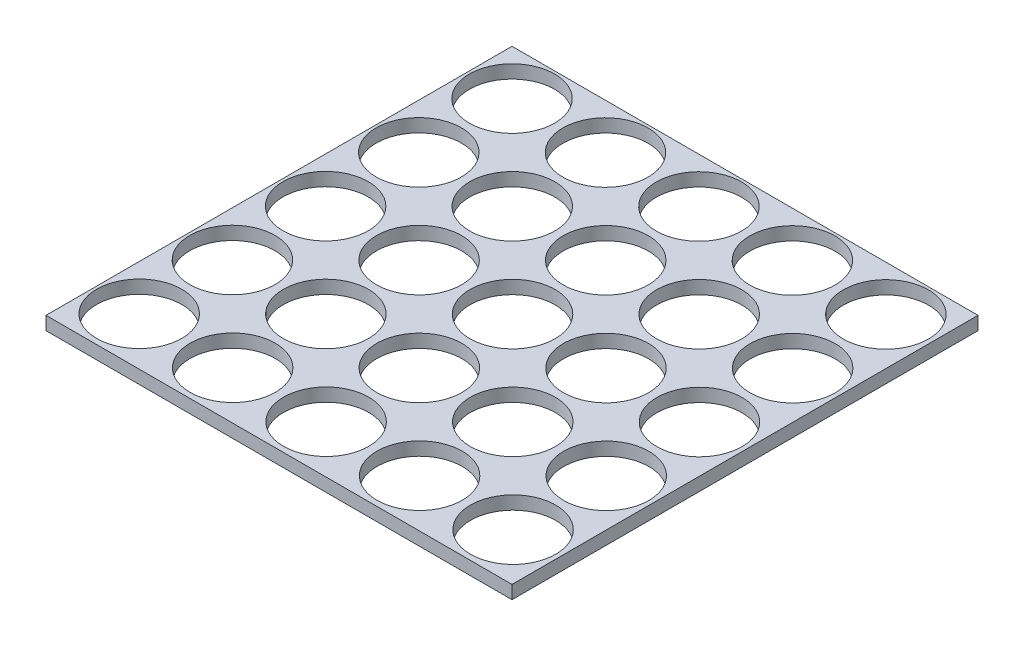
ISO-10303-21;
HEADER;
FILE_DESCRIPTION(('STEP AP214'),'2;1');
FILE_NAME('part.step','',(''),(''),'','','');
FILE_SCHEMA(('AUTOMOTIVE_DESIGN { 1 0 10303 214 1 1 1 1 }'));
ENDSEC;
DATA;
#1=APPLICATION_CONTEXT('core data for automotive mechanical design processes');
#2=APPLICATION_PROTOCOL_DEFINITION('international standard','automotive_design',2000,#1);
#3=PRODUCT_CONTEXT('',#1,'mechanical');
#4=PRODUCT('Part','Part','',(#3));
#5=PRODUCT_RELATED_PRODUCT_CATEGORY('part','',(#4));
#6=PRODUCT_DEFINITION_FORMATION('','',#4);
#7=PRODUCT_DEFINITION_CONTEXT('part definition',#1,'design');
#8=PRODUCT_DEFINITION('design','',#6,#7);
#9=PRODUCT_DEFINITION_SHAPE('','',#8);
#10=(LENGTH_UNIT() NAMED_UNIT(*) SI_UNIT(.MILLI.,.METRE.));
#11=(NAMED_UNIT(*) PLANE_ANGLE_UNIT() SI_UNIT($,.RADIAN.));
#12=(NAMED_UNIT(*) SI_UNIT($,.STERADIAN.) SOLID_ANGLE_UNIT());
#13=UNCERTAINTY_MEASURE_WITH_UNIT(LENGTH_MEASURE(1.E-05),#10,'distance_accuracy_value','');
#14=(GEOMETRIC_REPRESENTATION_CONTEXT(3) GLOBAL_UNCERTAINTY_ASSIGNED_CONTEXT((#13)) GLOBAL_UNIT_ASSIGNED_CONTEXT((#10,
#11,#12)) REPRESENTATION_CONTEXT('',''));
#15=CARTESIAN_POINT('',(0.,0.,0.));
#16=DIRECTION('',(0.,0.,1.));
#17=DIRECTION('',(1.,0.,0.));
#18=AXIS2_PLACEMENT_3D('',#15,#16,#17);
#19=CARTESIAN_POINT('',(-0.299999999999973,0.,69.7));
#20=DIRECTION('',(0.,1.,0.));
#21=DIRECTION('',(0.,0.,1.));
#22=AXIS2_PLACEMENT_3D('',#19,#20,#21);
#23=CYLINDRICAL_SURFACE('',#22,16.05);
#24=CARTESIAN_POINT('',(-0.299999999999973,0.,69.7));
#25=DIRECTION('',(0.,1.,0.));
#26=DIRECTION('',(0.,0.,1.));
#27=AXIS2_PLACEMENT_3D('',#24,#25,#26);
#28=CIRCLE('',#27,16.05);
#29=CARTESIAN_POINT('',(-0.299999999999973,0.,85.75));
#30=VERTEX_POINT('',#29);
#31=EDGE_CURVE('E48',#30,#30,#28,.T.);
#32=ORIENTED_EDGE('',*,*,#31,.F.);
#33=EDGE_LOOP('',(#32));
#34=FACE_BOUND('',#33,.T.);
#35=CARTESIAN_POINT('',(-0.299999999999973,5.,69.7));
#36=DIRECTION('',(0.,1.,0.));
#37=DIRECTION('',(0.,0.,1.));
#38=AXIS2_PLACEMENT_3D('',#35,#36,#37);
#39=CIRCLE('',#38,16.05);
#40=CARTESIAN_POINT('',(-0.299999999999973,5.,85.75));
#41=VERTEX_POINT('',#40);
#42=EDGE_CURVE('E11',#41,#41,#39,.T.);
#43=ORIENTED_EDGE('',*,*,#42,.T.);
#44=EDGE_LOOP('',(#43));
#45=FACE_BOUND('',#44,.T.);
#46=ADVANCED_FACE('F39',(#34,#45),#23,.F.);
#47=CARTESIAN_POINT('',(-0.299999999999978,0.,34.6));
#48=DIRECTION('',(0.,1.,0.));
#49=DIRECTION('',(0.,0.,1.));
#50=AXIS2_PLACEMENT_3D('',#47,#48,#49);
#51=CYLINDRICAL_SURFACE('',#50,16.05);
#52=CARTESIAN_POINT('',(-0.299999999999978,0.,34.6));
#53=DIRECTION('',(0.,1.,0.));
#54=DIRECTION('',(0.,0.,1.));
#55=AXIS2_PLACEMENT_3D('',#52,#53,#54);
#56=CIRCLE('',#55,16.05);
#57=CARTESIAN_POINT('',(-0.299999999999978,0.,50.65));
#58=VERTEX_POINT('',#57);
#59=EDGE_CURVE('E257',#58,#58,#56,.T.);
#60=ORIENTED_EDGE('',*,*,#59,.F.);
#61=EDGE_LOOP('',(#60));
#62=FACE_BOUND('',#61,.T.);
#63=CARTESIAN_POINT('',(-0.299999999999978,5.,34.6));
#64=DIRECTION('',(0.,1.,0.));
#65=DIRECTION('',(0.,0.,1.));
#66=AXIS2_PLACEMENT_3D('',#63,#64,#65);
#67=CIRCLE('',#66,16.05);
#68=CARTESIAN_POINT('',(-0.299999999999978,5.,50.65));
#69=VERTEX_POINT('',#68);
#70=EDGE_CURVE('E261',#69,#69,#67,.T.);
#71=ORIENTED_EDGE('',*,*,#70,.T.);
#72=EDGE_LOOP('',(#71));
#73=FACE_BOUND('',#72,.T.);
#74=ADVANCED_FACE('F272',(#62,#73),#51,.F.);
#75=CARTESIAN_POINT('',(-0.299999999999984,0.,-0.5));
#76=DIRECTION('',(0.,1.,0.));
#77=DIRECTION('',(0.,0.,1.));
#78=AXIS2_PLACEMENT_3D('',#75,#76,#77);
#79=CYLINDRICAL_SURFACE('',#78,16.05);
#80=CARTESIAN_POINT('',(-0.299999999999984,0.,-0.5));
#81=DIRECTION('',(0.,1.,0.));
#82=DIRECTION('',(0.,0.,1.));
#83=AXIS2_PLACEMENT_3D('',#80,#81,#82);
#84=CIRCLE('',#83,16.05);
#85=CARTESIAN_POINT('',(-0.299999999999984,0.,15.55));
#86=VERTEX_POINT('',#85);
#87=EDGE_CURVE('E249',#86,#86,#84,.T.);
#88=ORIENTED_EDGE('',*,*,#87,.F.);
#89=EDGE_LOOP('',(#88));
#90=FACE_BOUND('',#89,.T.);
#91=CARTESIAN_POINT('',(-0.299999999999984,5.,-0.5));
#92=DIRECTION('',(0.,1.,0.));
#93=DIRECTION('',(0.,0.,1.));
#94=AXIS2_PLACEMENT_3D('',#91,#92,#93);
#95=CIRCLE('',#94,16.05);
#96=CARTESIAN_POINT('',(-0.299999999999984,5.,15.55));
#97=VERTEX_POINT('',#96);
#98=EDGE_CURVE('E253',#97,#97,#95,.T.);
#99=ORIENTED_EDGE('',*,*,#98,.T.);
#100=EDGE_LOOP('',(#99));
#101=FACE_BOUND('',#100,.T.);
#102=ADVANCED_FACE('F359',(#90,#101),#79,.F.);
#103=CARTESIAN_POINT('',(34.9,0.,69.7));
#104=DIRECTION('',(0.,1.,0.));
#105=DIRECTION('',(0.,0.,1.));
#106=AXIS2_PLACEMENT_3D('',#103,#104,#105);
#107=CYLINDRICAL_SURFACE('',#106,16.05);
#108=CARTESIAN_POINT('',(34.9,0.,69.7));
#109=DIRECTION('',(0.,1.,0.));
#110=DIRECTION('',(0.,0.,1.));
#111=AXIS2_PLACEMENT_3D('',#108,#109,#110);
#112=CIRCLE('',#111,16.05);
#113=CARTESIAN_POINT('',(34.9,0.,85.75));
#114=VERTEX_POINT('',#113);
#115=EDGE_CURVE('E241',#114,#114,#112,.T.);
#116=ORIENTED_EDGE('',*,*,#115,.F.);
#117=EDGE_LOOP('',(#116));
#118=FACE_BOUND('',#117,.T.);
#119=CARTESIAN_POINT('',(34.9,5.,69.7));
#120=DIRECTION('',(0.,1.,0.));
#121=DIRECTION('',(0.,0.,1.));
#122=AXIS2_PLACEMENT_3D('',#119,#120,#121);
#123=CIRCLE('',#122,16.05);
#124=CARTESIAN_POINT('',(34.9,5.,85.75));
#125=VERTEX_POINT('',#124);
#126=EDGE_CURVE('E245',#125,#125,#123,.T.);
#127=ORIENTED_EDGE('',*,*,#126,.T.);
#128=EDGE_LOOP('',(#127));
#129=FACE_BOUND('',#128,.T.);
#130=ADVANCED_FACE('F355',(#118,#129),#107,.F.);
#131=CARTESIAN_POINT('',(34.9,0.,34.6));
#132=DIRECTION('',(0.,1.,0.));
#133=DIRECTION('',(0.,0.,1.));
#134=AXIS2_PLACEMENT_3D('',#131,#132,#133);
#135=CYLINDRICAL_SURFACE('',#134,16.05);
#136=CARTESIAN_POINT('',(34.9,0.,34.6));
#137=DIRECTION('',(0.,1.,0.));
#138=DIRECTION('',(0.,0.,1.));
#139=AXIS2_PLACEMENT_3D('',#136,#137,#138);
#140=CIRCLE('',#139,16.05);
#141=CARTESIAN_POINT('',(34.9,0.,50.65));
#142=VERTEX_POINT('',#141);
#143=EDGE_CURVE('E233',#142,#142,#140,.T.);
#144=ORIENTED_EDGE('',*,*,#143,.F.);
#145=EDGE_LOOP('',(#144));
#146=FACE_BOUND('',#145,.T.);
#147=CARTESIAN_POINT('',(34.9,5.,34.6));
#148=DIRECTION('',(0.,1.,0.));
#149=DIRECTION('',(0.,0.,1.));
#150=AXIS2_PLACEMENT_3D('',#147,#148,#149);
#151=CIRCLE('',#150,16.05);
#152=CARTESIAN_POINT('',(34.9,5.,50.65));
#153=VERTEX_POINT('',#152);
#154=EDGE_CURVE('E237',#153,#153,#151,.T.);
#155=ORIENTED_EDGE('',*,*,#154,.T.);
#156=EDGE_LOOP('',(#155));
#157=FACE_BOUND('',#156,.T.);
#158=ADVANCED_FACE('F351',(#146,#157),#135,.F.);
#159=CARTESIAN_POINT('',(34.9,0.,-0.5));
#160=DIRECTION('',(0.,1.,0.));
#161=DIRECTION('',(0.,0.,1.));
#162=AXIS2_PLACEMENT_3D('',#159,#160,#161);
#163=CYLINDRICAL_SURFACE('',#162,16.05);
#164=CARTESIAN_POINT('',(34.9,0.,-0.5));
#165=DIRECTION('',(0.,1.,0.));
#166=DIRECTION('',(0.,0.,1.));
#167=AXIS2_PLACEMENT_3D('',#164,#165,#166);
#168=CIRCLE('',#167,16.05);
#169=CARTESIAN_POINT('',(34.9,0.,15.55));
#170=VERTEX_POINT('',#169);
#171=EDGE_CURVE('E225',#170,#170,#168,.T.);
#172=ORIENTED_EDGE('',*,*,#171,.F.);
#173=EDGE_LOOP('',(#172));
#174=FACE_BOUND('',#173,.T.);
#175=CARTESIAN_POINT('',(34.9,5.,-0.5));
#176=DIRECTION('',(0.,1.,0.));
#177=DIRECTION('',(0.,0.,1.));
#178=AXIS2_PLACEMENT_3D('',#175,#176,#177);
#179=CIRCLE('',#178,16.05);
#180=CARTESIAN_POINT('',(34.9,5.,15.55));
#181=VERTEX_POINT('',#180);
#182=EDGE_CURVE('E229',#181,#181,#179,.T.);
#183=ORIENTED_EDGE('',*,*,#182,.T.);
#184=EDGE_LOOP('',(#183));
#185=FACE_BOUND('',#184,.T.);
#186=ADVANCED_FACE('F347',(#174,#185),#163,.F.);
#187=CARTESIAN_POINT('',(70.1,0.,69.7));
#188=DIRECTION('',(0.,1.,0.));
#189=DIRECTION('',(0.,0.,1.));
#190=AXIS2_PLACEMENT_3D('',#187,#188,#189);
#191=CYLINDRICAL_SURFACE('',#190,16.05);
#192=CARTESIAN_POINT('',(70.1,0.,69.7));
#193=DIRECTION('',(0.,1.,0.));
#194=DIRECTION('',(0.,0.,1.));
#195=AXIS2_PLACEMENT_3D('',#192,#193,#194);
#196=CIRCLE('',#195,16.05);
#197=CARTESIAN_POINT('',(70.1,0.,85.75));
#198=VERTEX_POINT('',#197);
#199=EDGE_CURVE('E217',#198,#198,#196,.T.);
#200=ORIENTED_EDGE('',*,*,#199,.F.);
#201=EDGE_LOOP('',(#200));
#202=FACE_BOUND('',#201,.T.);
#203=CARTESIAN_POINT('',(70.1,5.,69.7));
#204=DIRECTION('',(0.,1.,0.));
#205=DIRECTION('',(0.,0.,1.));
#206=AXIS2_PLACEMENT_3D('',#203,#204,#205);
#207=CIRCLE('',#206,16.05);
#208=CARTESIAN_POINT('',(70.1,5.,85.75));
#209=VERTEX_POINT('',#208);
#210=EDGE_CURVE('E221',#209,#209,#207,.T.);
#211=ORIENTED_EDGE('',*,*,#210,.T.);
#212=EDGE_LOOP('',(#211));
#213=FACE_BOUND('',#212,.T.);
#214=ADVANCED_FACE('F343',(#202,#213),#191,.F.);
#215=CARTESIAN_POINT('',(70.1,0.,34.6));
#216=DIRECTION('',(0.,1.,0.));
#217=DIRECTION('',(0.,0.,1.));
#218=AXIS2_PLACEMENT_3D('',#215,#216,#217);
#219=CYLINDRICAL_SURFACE('',#218,16.05);
#220=CARTESIAN_POINT('',(70.1,0.,34.6));
#221=DIRECTION('',(0.,1.,0.));
#222=DIRECTION('',(0.,0.,1.));
#223=AXIS2_PLACEMENT_3D('',#220,#221,#222);
#224=CIRCLE('',#223,16.05);
#225=CARTESIAN_POINT('',(70.1,0.,50.65));
#226=VERTEX_POINT('',#225);
#227=EDGE_CURVE('E209',#226,#226,#224,.T.);
#228=ORIENTED_EDGE('',*,*,#227,.F.);
#229=EDGE_LOOP('',(#228));
#230=FACE_BOUND('',#229,.T.);
#231=CARTESIAN_POINT('',(70.1,5.,34.6));
#232=DIRECTION('',(0.,1.,0.));
#233=DIRECTION('',(0.,0.,1.));
#234=AXIS2_PLACEMENT_3D('',#231,#232,#233);
#235=CIRCLE('',#234,16.05);
#236=CARTESIAN_POINT('',(70.1,5.,50.65));
#237=VERTEX_POINT('',#236);
#238=EDGE_CURVE('E213',#237,#237,#235,.T.);
#239=ORIENTED_EDGE('',*,*,#238,.T.);
#240=EDGE_LOOP('',(#239));
#241=FACE_BOUND('',#240,.T.);
#242=ADVANCED_FACE('F339',(#230,#241),#219,.F.);
#243=CARTESIAN_POINT('',(70.1,0.,-0.5));
#244=DIRECTION('',(0.,1.,0.));
#245=DIRECTION('',(0.,0.,1.));
#246=AXIS2_PLACEMENT_3D('',#243,#244,#245);
#247=CYLINDRICAL_SURFACE('',#246,16.05);
#248=CARTESIAN_POINT('',(70.1,0.,-0.5));
#249=DIRECTION('',(0.,1.,0.));
#250=DIRECTION('',(0.,0.,1.));
#251=AXIS2_PLACEMENT_3D('',#248,#249,#250);
#252=CIRCLE('',#251,16.05);
#253=CARTESIAN_POINT('',(70.1,0.,15.55));
#254=VERTEX_POINT('',#253);
#255=EDGE_CURVE('E201',#254,#254,#252,.T.);
#256=ORIENTED_EDGE('',*,*,#255,.F.);
#257=EDGE_LOOP('',(#256));
#258=FACE_BOUND('',#257,.T.);
#259=CARTESIAN_POINT('',(70.1,5.,-0.5));
#260=DIRECTION('',(0.,1.,0.));
#261=DIRECTION('',(0.,0.,1.));
#262=AXIS2_PLACEMENT_3D('',#259,#260,#261);
#263=CIRCLE('',#262,16.05);
#264=CARTESIAN_POINT('',(70.1,5.,15.55));
#265=VERTEX_POINT('',#264);
#266=EDGE_CURVE('E205',#265,#265,#263,.T.);
#267=ORIENTED_EDGE('',*,*,#266,.T.);
#268=EDGE_LOOP('',(#267));
#269=FACE_BOUND('',#268,.T.);
#270=ADVANCED_FACE('F335',(#258,#269),#247,.F.);
#271=CARTESIAN_POINT('',(-70.7,0.,69.7));
#272=DIRECTION('',(0.,1.,0.));
#273=DIRECTION('',(0.,0.,1.));
#274=AXIS2_PLACEMENT_3D('',#271,#272,#273);
#275=CYLINDRICAL_SURFACE('',#274,16.05);
#276=CARTESIAN_POINT('',(-70.7,0.,69.7));
#277=DIRECTION('',(0.,1.,0.));
#278=DIRECTION('',(0.,0.,1.));
#279=AXIS2_PLACEMENT_3D('',#276,#277,#278);
#280=CIRCLE('',#279,16.05);
#281=CARTESIAN_POINT('',(-70.7,0.,85.75));
#282=VERTEX_POINT('',#281);
#283=EDGE_CURVE('E193',#282,#282,#280,.T.);
#284=ORIENTED_EDGE('',*,*,#283,.F.);
#285=EDGE_LOOP('',(#284));
#286=FACE_BOUND('',#285,.T.);
#287=CARTESIAN_POINT('',(-70.7,5.,69.7));
#288=DIRECTION('',(0.,1.,0.));
#289=DIRECTION('',(0.,0.,1.));
#290=AXIS2_PLACEMENT_3D('',#287,#288,#289);
#291=CIRCLE('',#290,16.05);
#292=CARTESIAN_POINT('',(-70.7,5.,85.75));
#293=VERTEX_POINT('',#292);
#294=EDGE_CURVE('E197',#293,#293,#291,.T.);
#295=ORIENTED_EDGE('',*,*,#294,.T.);
#296=EDGE_LOOP('',(#295));
#297=FACE_BOUND('',#296,.T.);
#298=ADVANCED_FACE('F331',(#286,#297),#275,.F.);
#299=CARTESIAN_POINT('',(-70.7,0.,34.6));
#300=DIRECTION('',(0.,1.,0.));
#301=DIRECTION('',(0.,0.,1.));
#302=AXIS2_PLACEMENT_3D('',#299,#300,#301);
#303=CYLINDRICAL_SURFACE('',#302,16.05);
#304=CARTESIAN_POINT('',(-70.7,0.,34.6));
#305=DIRECTION('',(0.,1.,0.));
#306=DIRECTION('',(0.,0.,1.));
#307=AXIS2_PLACEMENT_3D('',#304,#305,#306);
#308=CIRCLE('',#307,16.05);
#309=CARTESIAN_POINT('',(-70.7,0.,50.65));
#310=VERTEX_POINT('',#309);
#311=EDGE_CURVE('E185',#310,#310,#308,.T.);
#312=ORIENTED_EDGE('',*,*,#311,.F.);
#313=EDGE_LOOP('',(#312));
#314=FACE_BOUND('',#313,.T.);
#315=CARTESIAN_POINT('',(-70.7,5.,34.6));
#316=DIRECTION('',(0.,1.,0.));
#317=DIRECTION('',(0.,0.,1.));
#318=AXIS2_PLACEMENT_3D('',#315,#316,#317);
#319=CIRCLE('',#318,16.05);
#320=CARTESIAN_POINT('',(-70.7,5.,50.65));
#321=VERTEX_POINT('',#320);
#322=EDGE_CURVE('E189',#321,#321,#319,.T.);
#323=ORIENTED_EDGE('',*,*,#322,.T.);
#324=EDGE_LOOP('',(#323));
#325=FACE_BOUND('',#324,.T.);
#326=ADVANCED_FACE('F327',(#314,#325),#303,.F.);
#327=CARTESIAN_POINT('',(-70.7,0.,-0.5));
#328=DIRECTION('',(0.,1.,0.));
#329=DIRECTION('',(0.,0.,1.));
#330=AXIS2_PLACEMENT_3D('',#327,#328,#329);
#331=CYLINDRICAL_SURFACE('',#330,16.05);
#332=CARTESIAN_POINT('',(-70.7,0.,-0.5));
#333=DIRECTION('',(0.,1.,0.));
#334=DIRECTION('',(0.,0.,1.));
#335=AXIS2_PLACEMENT_3D('',#332,#333,#334);
#336=CIRCLE('',#335,16.05);
#337=CARTESIAN_POINT('',(-70.7,0.,15.55));
#338=VERTEX_POINT('',#337);
#339=EDGE_CURVE('E177',#338,#338,#336,.T.);
#340=ORIENTED_EDGE('',*,*,#339,.F.);
#341=EDGE_LOOP('',(#340));
#342=FACE_BOUND('',#341,.T.);
#343=CARTESIAN_POINT('',(-70.7,5.,-0.5));
#344=DIRECTION('',(0.,1.,0.));
#345=DIRECTION('',(0.,0.,1.));
#346=AXIS2_PLACEMENT_3D('',#343,#344,#345);
#347=CIRCLE('',#346,16.05);
#348=CARTESIAN_POINT('',(-70.7,5.,15.55));
#349=VERTEX_POINT('',#348);
#350=EDGE_CURVE('E181',#349,#349,#347,.T.);
#351=ORIENTED_EDGE('',*,*,#350,.T.);
#352=EDGE_LOOP('',(#351));
#353=FACE_BOUND('',#352,.T.);
#354=ADVANCED_FACE('F323',(#342,#353),#331,.F.);
#355=CARTESIAN_POINT('',(-35.5,0.,69.7));
#356=DIRECTION('',(0.,1.,0.));
#357=DIRECTION('',(0.,0.,1.));
#358=AXIS2_PLACEMENT_3D('',#355,#356,#357);
#359=CYLINDRICAL_SURFACE('',#358,16.05);
#360=CARTESIAN_POINT('',(-35.5,0.,69.7));
#361=DIRECTION('',(0.,1.,0.));
#362=DIRECTION('',(0.,0.,1.));
#363=AXIS2_PLACEMENT_3D('',#360,#361,#362);
#364=CIRCLE('',#363,16.05);
#365=CARTESIAN_POINT('',(-35.5,0.,85.75));
#366=VERTEX_POINT('',#365);
#367=EDGE_CURVE('E169',#366,#366,#364,.T.);
#368=ORIENTED_EDGE('',*,*,#367,.F.);
#369=EDGE_LOOP('',(#368));
#370=FACE_BOUND('',#369,.T.);
#371=CARTESIAN_POINT('',(-35.5,5.,69.7));
#372=DIRECTION('',(0.,1.,0.));
#373=DIRECTION('',(0.,0.,1.));
#374=AXIS2_PLACEMENT_3D('',#371,#372,#373);
#375=CIRCLE('',#374,16.05);
#376=CARTESIAN_POINT('',(-35.5,5.,85.75));
#377=VERTEX_POINT('',#376);
#378=EDGE_CURVE('E173',#377,#377,#375,.T.);
#379=ORIENTED_EDGE('',*,*,#378,.T.);
#380=EDGE_LOOP('',(#379));
#381=FACE_BOUND('',#380,.T.);
#382=ADVANCED_FACE('F319',(#370,#381),#359,.F.);
#383=CARTESIAN_POINT('',(-35.5,0.,34.6));
#384=DIRECTION('',(0.,1.,0.));
#385=DIRECTION('',(0.,0.,1.));
#386=AXIS2_PLACEMENT_3D('',#383,#384,#385);
#387=CYLINDRICAL_SURFACE('',#386,16.05);
#388=CARTESIAN_POINT('',(-35.5,0.,34.6));
#389=DIRECTION('',(0.,1.,0.));
#390=DIRECTION('',(0.,0.,1.));
#391=AXIS2_PLACEMENT_3D('',#388,#389,#390);
#392=CIRCLE('',#391,16.05);
#393=CARTESIAN_POINT('',(-35.5,0.,50.65));
#394=VERTEX_POINT('',#393);
#395=EDGE_CURVE('E161',#394,#394,#392,.T.);
#396=ORIENTED_EDGE('',*,*,#395,.F.);
#397=EDGE_LOOP('',(#396));
#398=FACE_BOUND('',#397,.T.);
#399=CARTESIAN_POINT('',(-35.5,5.,34.6));
#400=DIRECTION('',(0.,1.,0.));
#401=DIRECTION('',(0.,0.,1.));
#402=AXIS2_PLACEMENT_3D('',#399,#400,#401);
#403=CIRCLE('',#402,16.05);
#404=CARTESIAN_POINT('',(-35.5,5.,50.65));
#405=VERTEX_POINT('',#404);
#406=EDGE_CURVE('E165',#405,#405,#403,.T.);
#407=ORIENTED_EDGE('',*,*,#406,.T.);
#408=EDGE_LOOP('',(#407));
#409=FACE_BOUND('',#408,.T.);
#410=ADVANCED_FACE('F315',(#398,#409),#387,.F.);
#411=CARTESIAN_POINT('',(-35.5,0.,-0.5));
#412=DIRECTION('',(0.,1.,0.));
#413=DIRECTION('',(0.,0.,1.));
#414=AXIS2_PLACEMENT_3D('',#411,#412,#413);
#415=CYLINDRICAL_SURFACE('',#414,16.05);
#416=CARTESIAN_POINT('',(-35.5,0.,-0.5));
#417=DIRECTION('',(0.,1.,0.));
#418=DIRECTION('',(0.,0.,1.));
#419=AXIS2_PLACEMENT_3D('',#416,#417,#418);
#420=CIRCLE('',#419,16.05);
#421=CARTESIAN_POINT('',(-35.5,0.,15.55));
#422=VERTEX_POINT('',#421);
#423=EDGE_CURVE('E153',#422,#422,#420,.T.);
#424=ORIENTED_EDGE('',*,*,#423,.F.);
#425=EDGE_LOOP('',(#424));
#426=FACE_BOUND('',#425,.T.);
#427=CARTESIAN_POINT('',(-35.5,5.,-0.5));
#428=DIRECTION('',(0.,1.,0.));
#429=DIRECTION('',(0.,0.,1.));
#430=AXIS2_PLACEMENT_3D('',#427,#428,#429);
#431=CIRCLE('',#430,16.05);
#432=CARTESIAN_POINT('',(-35.5,5.,15.55));
#433=VERTEX_POINT('',#432);
#434=EDGE_CURVE('E157',#433,#433,#431,.T.);
#435=ORIENTED_EDGE('',*,*,#434,.T.);
#436=EDGE_LOOP('',(#435));
#437=FACE_BOUND('',#436,.T.);
#438=ADVANCED_FACE('F311',(#426,#437),#415,.F.);
#439=CARTESIAN_POINT('',(70.1,0.,-70.7));
#440=DIRECTION('',(0.,1.,0.));
#441=DIRECTION('',(0.,0.,1.));
#442=AXIS2_PLACEMENT_3D('',#439,#440,#441);
#443=CYLINDRICAL_SURFACE('',#442,16.05);
#444=CARTESIAN_POINT('',(70.1,0.,-70.7));
#445=DIRECTION('',(0.,1.,0.));
#446=DIRECTION('',(0.,0.,1.));
#447=AXIS2_PLACEMENT_3D('',#444,#445,#446);
#448=CIRCLE('',#447,16.05);
#449=CARTESIAN_POINT('',(70.1,0.,-54.65));
#450=VERTEX_POINT('',#449);
#451=EDGE_CURVE('E145',#450,#450,#448,.T.);
#452=ORIENTED_EDGE('',*,*,#451,.F.);
#453=EDGE_LOOP('',(#452));
#454=FACE_BOUND('',#453,.T.);
#455=CARTESIAN_POINT('',(70.1,5.,-70.7));
#456=DIRECTION('',(0.,1.,0.));
#457=DIRECTION('',(0.,0.,1.));
#458=AXIS2_PLACEMENT_3D('',#455,#456,#457);
#459=CIRCLE('',#458,16.05);
#460=CARTESIAN_POINT('',(70.1,5.,-54.65));
#461=VERTEX_POINT('',#460);
#462=EDGE_CURVE('E149',#461,#461,#459,.T.);
#463=ORIENTED_EDGE('',*,*,#462,.T.);
#464=EDGE_LOOP('',(#463));
#465=FACE_BOUND('',#464,.T.);
#466=ADVANCED_FACE('F307',(#454,#465),#443,.F.);
#467=CARTESIAN_POINT('',(34.9,0.,-70.7));
#468=DIRECTION('',(0.,1.,0.));
#469=DIRECTION('',(0.,0.,1.));
#470=AXIS2_PLACEMENT_3D('',#467,#468,#469);
#471=CYLINDRICAL_SURFACE('',#470,16.05);
#472=CARTESIAN_POINT('',(34.9,0.,-70.7));
#473=DIRECTION('',(0.,1.,0.));
#474=DIRECTION('',(0.,0.,1.));
#475=AXIS2_PLACEMENT_3D('',#472,#473,#474);
#476=CIRCLE('',#475,16.05);
#477=CARTESIAN_POINT('',(34.9,0.,-54.65));
#478=VERTEX_POINT('',#477);
#479=EDGE_CURVE('E137',#478,#478,#476,.T.);
#480=ORIENTED_EDGE('',*,*,#479,.F.);
#481=EDGE_LOOP('',(#480));
#482=FACE_BOUND('',#481,.T.);
#483=CARTESIAN_POINT('',(34.9,5.,-70.7));
#484=DIRECTION('',(0.,1.,0.));
#485=DIRECTION('',(0.,0.,1.));
#486=AXIS2_PLACEMENT_3D('',#483,#484,#485);
#487=CIRCLE('',#486,16.05);
#488=CARTESIAN_POINT('',(34.9,5.,-54.65));
#489=VERTEX_POINT('',#488);
#490=EDGE_CURVE('E141',#489,#489,#487,.T.);
#491=ORIENTED_EDGE('',*,*,#490,.T.);
#492=EDGE_LOOP('',(#491));
#493=FACE_BOUND('',#492,.T.);
#494=ADVANCED_FACE('F303',(#482,#493),#471,.F.);
#495=CARTESIAN_POINT('',(-0.299999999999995,0.,-70.7));
#496=DIRECTION('',(0.,1.,0.));
#497=DIRECTION('',(0.,0.,1.));
#498=AXIS2_PLACEMENT_3D('',#495,#496,#497);
#499=CYLINDRICAL_SURFACE('',#498,16.05);
#500=CARTESIAN_POINT('',(-0.299999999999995,0.,-70.7));
#501=DIRECTION('',(0.,1.,0.));
#502=DIRECTION('',(0.,0.,1.));
#503=AXIS2_PLACEMENT_3D('',#500,#501,#502);
#504=CIRCLE('',#503,16.05);
#505=CARTESIAN_POINT('',(-0.299999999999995,0.,-54.65));
#506=VERTEX_POINT('',#505);
#507=EDGE_CURVE('E129',#506,#506,#504,.T.);
#508=ORIENTED_EDGE('',*,*,#507,.F.);
#509=EDGE_LOOP('',(#508));
#510=FACE_BOUND('',#509,.T.);
#511=CARTESIAN_POINT('',(-0.299999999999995,5.,-70.7));
#512=DIRECTION('',(0.,1.,0.));
#513=DIRECTION('',(0.,0.,1.));
#514=AXIS2_PLACEMENT_3D('',#511,#512,#513);
#515=CIRCLE('',#514,16.05);
#516=CARTESIAN_POINT('',(-0.299999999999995,5.,-54.65));
#517=VERTEX_POINT('',#516);
#518=EDGE_CURVE('E133',#517,#517,#515,.T.);
#519=ORIENTED_EDGE('',*,*,#518,.T.);
#520=EDGE_LOOP('',(#519));
#521=FACE_BOUND('',#520,.T.);
#522=ADVANCED_FACE('F299',(#510,#521),#499,.F.);
#523=CARTESIAN_POINT('',(87.75,5.,-87.75));
#524=DIRECTION('',(-1.,0.,0.));
#525=DIRECTION('',(0.,0.,1.));
#526=AXIS2_PLACEMENT_3D('',#523,#524,#525);
#527=PLANE('',#526);
#528=DIRECTION('',(0.,0.,-1.));
#529=VECTOR('',#528,1.);
#530=CARTESIAN_POINT('',(87.75,0.,-87.75));
#531=LINE('',#530,#529);
#532=CARTESIAN_POINT('',(87.75,0.,87.75));
#533=VERTEX_POINT('',#532);
#534=CARTESIAN_POINT('',(87.75,0.,-87.75));
#535=VERTEX_POINT('',#534);
#536=EDGE_CURVE('E112',#533,#535,#531,.T.);
#537=ORIENTED_EDGE('',*,*,#536,.T.);
#538=DIRECTION('',(0.,-1.,0.));
#539=VECTOR('',#538,1.);
#540=CARTESIAN_POINT('',(87.75,5.,-87.75));
#541=LINE('',#540,#539);
#542=CARTESIAN_POINT('',(87.75,5.,-87.75));
#543=VERTEX_POINT('',#542);
#544=EDGE_CURVE('E101',#543,#535,#541,.T.);
#545=ORIENTED_EDGE('',*,*,#544,.F.);
#546=DIRECTION('',(0.,0.,-1.));
#547=VECTOR('',#546,1.);
#548=CARTESIAN_POINT('',(87.75,5.,-87.75));
#549=LINE('',#548,#547);
#550=CARTESIAN_POINT('',(87.75,5.,87.75));
#551=VERTEX_POINT('',#550);
#552=EDGE_CURVE('E93',#551,#543,#549,.T.);
#553=ORIENTED_EDGE('',*,*,#552,.F.);
#554=DIRECTION('',(0.,-1.,0.));
#555=VECTOR('',#554,1.);
#556=CARTESIAN_POINT('',(87.75,5.,87.75));
#557=LINE('',#556,#555);
#558=EDGE_CURVE('E108',#551,#533,#557,.T.);
#559=ORIENTED_EDGE('',*,*,#558,.T.);
#560=EDGE_LOOP('',(#537,#545,#553,#559));
#561=FACE_BOUND('',#560,.T.);
#562=ADVANCED_FACE('F296',(#561),#527,.F.);
#563=CARTESIAN_POINT('',(-87.75,5.,-87.75));
#564=DIRECTION('',(0.,0.,1.));
#565=DIRECTION('',(1.,0.,0.));
#566=AXIS2_PLACEMENT_3D('',#563,#564,#565);
#567=PLANE('',#566);
#568=DIRECTION('',(-1.,0.,0.));
#569=VECTOR('',#568,1.);
#570=CARTESIAN_POINT('',(-87.75,0.,-87.75));
#571=LINE('',#570,#569);
#572=CARTESIAN_POINT('',(-87.75,0.,-87.75));
#573=VERTEX_POINT('',#572);
#574=EDGE_CURVE('E99',#535,#573,#571,.T.);
#575=ORIENTED_EDGE('',*,*,#574,.T.);
#576=DIRECTION('',(0.,-1.,0.));
#577=VECTOR('',#576,1.);
#578=CARTESIAN_POINT('',(-87.75,5.,-87.75));
#579=LINE('',#578,#577);
#580=CARTESIAN_POINT('',(-87.75,5.,-87.75));
#581=VERTEX_POINT('',#580);
#582=EDGE_CURVE('E97',#581,#573,#579,.T.);
#583=ORIENTED_EDGE('',*,*,#582,.F.);
#584=DIRECTION('',(-1.,0.,0.));
#585=VECTOR('',#584,1.);
#586=CARTESIAN_POINT('',(-87.75,5.,-87.75));
#587=LINE('',#586,#585);
#588=EDGE_CURVE('E87',#543,#581,#587,.T.);
#589=ORIENTED_EDGE('',*,*,#588,.F.);
#590=ORIENTED_EDGE('',*,*,#544,.T.);
#591=EDGE_LOOP('',(#575,#583,#589,#590));
#592=FACE_BOUND('',#591,.T.);
#593=ADVANCED_FACE('F98',(#592),#567,.F.);
#594=CARTESIAN_POINT('',(-87.75,5.,-87.75));
#595=DIRECTION('',(1.,0.,0.));
#596=DIRECTION('',(0.,0.,-1.));
#597=AXIS2_PLACEMENT_3D('',#594,#595,#596);
#598=PLANE('',#597);
#599=DIRECTION('',(0.,0.,1.));
#600=VECTOR('',#599,1.);
#601=CARTESIAN_POINT('',(-87.75,0.,-87.75));
#602=LINE('',#601,#600);
#603=CARTESIAN_POINT('',(-87.75,0.,87.75));
#604=VERTEX_POINT('',#603);
#605=EDGE_CURVE('E73',#573,#604,#602,.T.);
#606=ORIENTED_EDGE('',*,*,#605,.T.);
#607=DIRECTION('',(0.,-1.,0.));
#608=VECTOR('',#607,1.);
#609=CARTESIAN_POINT('',(-87.75,5.,87.75));
#610=LINE('',#609,#608);
#611=CARTESIAN_POINT('',(-87.75,5.,87.75));
#612=VERTEX_POINT('',#611);
#613=EDGE_CURVE('E102',#612,#604,#610,.T.);
#614=ORIENTED_EDGE('',*,*,#613,.F.);
#615=DIRECTION('',(0.,0.,1.));
#616=VECTOR('',#615,1.);
#617=CARTESIAN_POINT('',(-87.75,5.,-87.75));
#618=LINE('',#617,#616);
#619=EDGE_CURVE('E91',#581,#612,#618,.T.);
#620=ORIENTED_EDGE('',*,*,#619,.F.);
#621=ORIENTED_EDGE('',*,*,#582,.T.);
#622=EDGE_LOOP('',(#606,#614,#620,#621));
#623=FACE_BOUND('',#622,.T.);
#624=ADVANCED_FACE('F104',(#623),#598,.F.);
#625=CARTESIAN_POINT('',(-87.75,5.,87.75));
#626=DIRECTION('',(0.,0.,-1.));
#627=DIRECTION('',(-1.,0.,0.));
#628=AXIS2_PLACEMENT_3D('',#625,#626,#627);
#629=PLANE('',#628);
#630=DIRECTION('',(1.,0.,0.));
#631=VECTOR('',#630,1.);
#632=CARTESIAN_POINT('',(-87.75,0.,87.75));
#633=LINE('',#632,#631);
#634=EDGE_CURVE('E79',#604,#533,#633,.T.);
#635=ORIENTED_EDGE('',*,*,#634,.T.);
#636=ORIENTED_EDGE('',*,*,#558,.F.);
#637=DIRECTION('',(1.,0.,0.));
#638=VECTOR('',#637,1.);
#639=CARTESIAN_POINT('',(-87.75,5.,87.75));
#640=LINE('',#639,#638);
#641=EDGE_CURVE('E56',#612,#551,#640,.T.);
#642=ORIENTED_EDGE('',*,*,#641,.F.);
#643=ORIENTED_EDGE('',*,*,#613,.T.);
#644=EDGE_LOOP('',(#635,#636,#642,#643));
#645=FACE_BOUND('',#644,.T.);
#646=ADVANCED_FACE('F276',(#645),#629,.F.);
#647=CARTESIAN_POINT('',(0.,5.,0.));
#648=DIRECTION('',(0.,1.,0.));
#649=DIRECTION('',(0.,0.,1.));
#650=AXIS2_PLACEMENT_3D('',#647,#648,#649);
#651=PLANE('',#650);
#652=CARTESIAN_POINT('',(-0.299999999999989,5.,-35.6));
#653=DIRECTION('',(0.,1.,0.));
#654=DIRECTION('',(0.,0.,1.));
#655=AXIS2_PLACEMENT_3D('',#652,#653,#654);
#656=CIRCLE('',#655,16.05);
#657=CARTESIAN_POINT('',(-0.299999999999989,5.,-19.55));
#658=VERTEX_POINT('',#657);
#659=EDGE_CURVE('E572',#658,#658,#656,.T.);
#660=ORIENTED_EDGE('',*,*,#659,.F.);
#661=EDGE_LOOP('',(#660));
#662=FACE_BOUND('',#661,.T.);
#663=CARTESIAN_POINT('',(34.9,5.,-35.6));
#664=DIRECTION('',(0.,1.,0.));
#665=DIRECTION('',(0.,0.,1.));
#666=AXIS2_PLACEMENT_3D('',#663,#664,#665);
#667=CIRCLE('',#666,16.05);
#668=CARTESIAN_POINT('',(34.9,5.,-19.55));
#669=VERTEX_POINT('',#668);
#670=EDGE_CURVE('E579',#669,#669,#667,.T.);
#671=ORIENTED_EDGE('',*,*,#670,.F.);
#672=EDGE_LOOP('',(#671));
#673=FACE_BOUND('',#672,.T.);
#674=CARTESIAN_POINT('',(70.1,5.,-35.6));
#675=DIRECTION('',(0.,1.,0.));
#676=DIRECTION('',(0.,0.,1.));
#677=AXIS2_PLACEMENT_3D('',#674,#675,#676);
#678=CIRCLE('',#677,16.05);
#679=CARTESIAN_POINT('',(70.1,5.,-19.55));
#680=VERTEX_POINT('',#679);
#681=EDGE_CURVE('E590',#680,#680,#678,.T.);
#682=ORIENTED_EDGE('',*,*,#681,.F.);
#683=EDGE_LOOP('',(#682));
#684=FACE_BOUND('',#683,.T.);
#685=CARTESIAN_POINT('',(-70.7,5.,-35.6));
#686=DIRECTION('',(0.,1.,0.));
#687=DIRECTION('',(0.,0.,1.));
#688=AXIS2_PLACEMENT_3D('',#685,#686,#687);
#689=CIRCLE('',#688,16.05);
#690=CARTESIAN_POINT('',(-70.7,5.,-19.55));
#691=VERTEX_POINT('',#690);
#692=EDGE_CURVE('E598',#691,#691,#689,.T.);
#693=ORIENTED_EDGE('',*,*,#692,.F.);
#694=EDGE_LOOP('',(#693));
#695=FACE_BOUND('',#694,.T.);
#696=CARTESIAN_POINT('',(-35.5,5.,-35.6));
#697=DIRECTION('',(0.,1.,0.));
#698=DIRECTION('',(0.,0.,1.));
#699=AXIS2_PLACEMENT_3D('',#696,#697,#698);
#700=CIRCLE('',#699,16.05);
#701=CARTESIAN_POINT('',(-35.5,5.,-19.55));
#702=VERTEX_POINT('',#701);
#703=EDGE_CURVE('E606',#702,#702,#700,.T.);
#704=ORIENTED_EDGE('',*,*,#703,.F.);
#705=EDGE_LOOP('',(#704));
#706=FACE_BOUND('',#705,.T.);
#707=CARTESIAN_POINT('',(-35.5,5.,-70.7));
#708=DIRECTION('',(0.,1.,0.));
#709=DIRECTION('',(0.,0.,1.));
#710=AXIS2_PLACEMENT_3D('',#707,#708,#709);
#711=CIRCLE('',#710,16.05);
#712=CARTESIAN_POINT('',(-35.5,5.,-54.65));
#713=VERTEX_POINT('',#712);
#714=EDGE_CURVE('E614',#713,#713,#711,.T.);
#715=ORIENTED_EDGE('',*,*,#714,.F.);
#716=EDGE_LOOP('',(#715));
#717=FACE_BOUND('',#716,.T.);
#718=CARTESIAN_POINT('',(-70.7,5.,-70.7));
#719=DIRECTION('',(0.,1.,0.));
#720=DIRECTION('',(0.,0.,1.));
#721=AXIS2_PLACEMENT_3D('',#718,#719,#720);
#722=CIRCLE('',#721,16.05);
#723=CARTESIAN_POINT('',(-70.7,5.,-54.65));
#724=VERTEX_POINT('',#723);
#725=EDGE_CURVE('E618',#724,#724,#722,.T.);
#726=ORIENTED_EDGE('',*,*,#725,.F.);
#727=EDGE_LOOP('',(#726));
#728=FACE_BOUND('',#727,.T.);
#729=ORIENTED_EDGE('',*,*,#552,.T.);
#730=ORIENTED_EDGE('',*,*,#588,.T.);
#731=ORIENTED_EDGE('',*,*,#619,.T.);
#732=ORIENTED_EDGE('',*,*,#641,.T.);
#733=EDGE_LOOP('',(#729,#730,#731,#732));
#734=FACE_BOUND('',#733,.T.);
#735=ORIENTED_EDGE('',*,*,#518,.F.);
#736=EDGE_LOOP('',(#735));
#737=FACE_BOUND('',#736,.T.);
#738=ORIENTED_EDGE('',*,*,#490,.F.);
#739=EDGE_LOOP('',(#738));
#740=FACE_BOUND('',#739,.T.);
#741=ORIENTED_EDGE('',*,*,#462,.F.);
#742=EDGE_LOOP('',(#741));
#743=FACE_BOUND('',#742,.T.);
#744=ORIENTED_EDGE('',*,*,#434,.F.);
#745=EDGE_LOOP('',(#744));
#746=FACE_BOUND('',#745,.T.);
#747=ORIENTED_EDGE('',*,*,#406,.F.);
#748=EDGE_LOOP('',(#747));
#749=FACE_BOUND('',#748,.T.);
#750=ORIENTED_EDGE('',*,*,#378,.F.);
#751=EDGE_LOOP('',(#750));
#752=FACE_BOUND('',#751,.T.);
#753=ORIENTED_EDGE('',*,*,#350,.F.);
#754=EDGE_LOOP('',(#753));
#755=FACE_BOUND('',#754,.T.);
#756=ORIENTED_EDGE('',*,*,#322,.F.);
#757=EDGE_LOOP('',(#756));
#758=FACE_BOUND('',#757,.T.);
#759=ORIENTED_EDGE('',*,*,#294,.F.);
#760=EDGE_LOOP('',(#759));
#761=FACE_BOUND('',#760,.T.);
#762=ORIENTED_EDGE('',*,*,#266,.F.);
#763=EDGE_LOOP('',(#762));
#764=FACE_BOUND('',#763,.T.);
#765=ORIENTED_EDGE('',*,*,#238,.F.);
#766=EDGE_LOOP('',(#765));
#767=FACE_BOUND('',#766,.T.);
#768=ORIENTED_EDGE('',*,*,#210,.F.);
#769=EDGE_LOOP('',(#768));
#770=FACE_BOUND('',#769,.T.);
#771=ORIENTED_EDGE('',*,*,#182,.F.);
#772=EDGE_LOOP('',(#771));
#773=FACE_BOUND('',#772,.T.);
#774=ORIENTED_EDGE('',*,*,#154,.F.);
#775=EDGE_LOOP('',(#774));
#776=FACE_BOUND('',#775,.T.);
#777=ORIENTED_EDGE('',*,*,#126,.F.);
#778=EDGE_LOOP('',(#777));
#779=FACE_BOUND('',#778,.T.);
#780=ORIENTED_EDGE('',*,*,#98,.F.);
#781=EDGE_LOOP('',(#780));
#782=FACE_BOUND('',#781,.T.);
#783=ORIENTED_EDGE('',*,*,#70,.F.);
#784=EDGE_LOOP('',(#783));
#785=FACE_BOUND('',#784,.T.);
#786=ORIENTED_EDGE('',*,*,#42,.F.);
#787=EDGE_LOOP('',(#786));
#788=FACE_BOUND('',#787,.T.);
#789=ADVANCED_FACE('F88',(#662,#673,#684,#695,#706,#717,#728,#734,#737,#740,#743,#746,#749,#752,
#755,#758,#761,#764,#767,#770,#773,#776,#779,#782,#785,#788),#651,.T.);
#790=CARTESIAN_POINT('',(0.,0.,0.));
#791=DIRECTION('',(0.,1.,0.));
#792=DIRECTION('',(0.,0.,1.));
#793=AXIS2_PLACEMENT_3D('',#790,#791,#792);
#794=PLANE('',#793);
#795=CARTESIAN_POINT('',(-0.299999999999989,0.,-35.6));
#796=DIRECTION('',(0.,1.,0.));
#797=DIRECTION('',(0.,0.,1.));
#798=AXIS2_PLACEMENT_3D('',#795,#796,#797);
#799=CIRCLE('',#798,16.05);
#800=CARTESIAN_POINT('',(-0.299999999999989,0.,-19.55));
#801=VERTEX_POINT('',#800);
#802=EDGE_CURVE('E570',#801,#801,#799,.T.);
#803=ORIENTED_EDGE('',*,*,#802,.T.);
#804=EDGE_LOOP('',(#803));
#805=FACE_BOUND('',#804,.T.);
#806=CARTESIAN_POINT('',(34.9,0.,-35.6));
#807=DIRECTION('',(0.,1.,0.));
#808=DIRECTION('',(0.,0.,1.));
#809=AXIS2_PLACEMENT_3D('',#806,#807,#808);
#810=CIRCLE('',#809,16.05);
#811=CARTESIAN_POINT('',(34.9,0.,-19.55));
#812=VERTEX_POINT('',#811);
#813=EDGE_CURVE('E574',#812,#812,#810,.T.);
#814=ORIENTED_EDGE('',*,*,#813,.T.);
#815=EDGE_LOOP('',(#814));
#816=FACE_BOUND('',#815,.T.);
#817=CARTESIAN_POINT('',(70.1,0.,-35.6));
#818=DIRECTION('',(0.,1.,0.));
#819=DIRECTION('',(0.,0.,1.));
#820=AXIS2_PLACEMENT_3D('',#817,#818,#819);
#821=CIRCLE('',#820,16.05);
#822=CARTESIAN_POINT('',(70.1,0.,-19.55));
#823=VERTEX_POINT('',#822);
#824=EDGE_CURVE('E586',#823,#823,#821,.T.);
#825=ORIENTED_EDGE('',*,*,#824,.T.);
#826=EDGE_LOOP('',(#825));
#827=FACE_BOUND('',#826,.T.);
#828=CARTESIAN_POINT('',(-70.7,0.,-35.6));
#829=DIRECTION('',(0.,1.,0.));
#830=DIRECTION('',(0.,0.,1.));
#831=AXIS2_PLACEMENT_3D('',#828,#829,#830);
#832=CIRCLE('',#831,16.05);
#833=CARTESIAN_POINT('',(-70.7,0.,-19.55));
#834=VERTEX_POINT('',#833);
#835=EDGE_CURVE('E594',#834,#834,#832,.T.);
#836=ORIENTED_EDGE('',*,*,#835,.T.);
#837=EDGE_LOOP('',(#836));
#838=FACE_BOUND('',#837,.T.);
#839=CARTESIAN_POINT('',(-35.5,0.,-35.6));
#840=DIRECTION('',(0.,1.,0.));
#841=DIRECTION('',(0.,0.,1.));
#842=AXIS2_PLACEMENT_3D('',#839,#840,#841);
#843=CIRCLE('',#842,16.05);
#844=CARTESIAN_POINT('',(-35.5,0.,-19.55));
#845=VERTEX_POINT('',#844);
#846=EDGE_CURVE('E602',#845,#845,#843,.T.);
#847=ORIENTED_EDGE('',*,*,#846,.T.);
#848=EDGE_LOOP('',(#847));
#849=FACE_BOUND('',#848,.T.);
#850=CARTESIAN_POINT('',(-35.5,0.,-70.7));
#851=DIRECTION('',(0.,1.,0.));
#852=DIRECTION('',(0.,0.,1.));
#853=AXIS2_PLACEMENT_3D('',#850,#851,#852);
#854=CIRCLE('',#853,16.05);
#855=CARTESIAN_POINT('',(-35.5,0.,-54.65));
#856=VERTEX_POINT('',#855);
#857=EDGE_CURVE('E610',#856,#856,#854,.T.);
#858=ORIENTED_EDGE('',*,*,#857,.T.);
#859=EDGE_LOOP('',(#858));
#860=FACE_BOUND('',#859,.T.);
#861=CARTESIAN_POINT('',(-70.7,0.,-70.7));
#862=DIRECTION('',(0.,1.,0.));
#863=DIRECTION('',(0.,0.,1.));
#864=AXIS2_PLACEMENT_3D('',#861,#862,#863);
#865=CIRCLE('',#864,16.05);
#866=CARTESIAN_POINT('',(-70.7,0.,-54.65));
#867=VERTEX_POINT('',#866);
#868=EDGE_CURVE('E116',#867,#867,#865,.T.);
#869=ORIENTED_EDGE('',*,*,#868,.T.);
#870=EDGE_LOOP('',(#869));
#871=FACE_BOUND('',#870,.T.);
#872=ORIENTED_EDGE('',*,*,#536,.F.);
#873=ORIENTED_EDGE('',*,*,#634,.F.);
#874=ORIENTED_EDGE('',*,*,#605,.F.);
#875=ORIENTED_EDGE('',*,*,#574,.F.);
#876=EDGE_LOOP('',(#872,#873,#874,#875));
#877=FACE_BOUND('',#876,.T.);
#878=ORIENTED_EDGE('',*,*,#507,.T.);
#879=EDGE_LOOP('',(#878));
#880=FACE_BOUND('',#879,.T.);
#881=ORIENTED_EDGE('',*,*,#479,.T.);
#882=EDGE_LOOP('',(#881));
#883=FACE_BOUND('',#882,.T.);
#884=ORIENTED_EDGE('',*,*,#451,.T.);
#885=EDGE_LOOP('',(#884));
#886=FACE_BOUND('',#885,.T.);
#887=ORIENTED_EDGE('',*,*,#423,.T.);
#888=EDGE_LOOP('',(#887));
#889=FACE_BOUND('',#888,.T.);
#890=ORIENTED_EDGE('',*,*,#395,.T.);
#891=EDGE_LOOP('',(#890));
#892=FACE_BOUND('',#891,.T.);
#893=ORIENTED_EDGE('',*,*,#367,.T.);
#894=EDGE_LOOP('',(#893));
#895=FACE_BOUND('',#894,.T.);
#896=ORIENTED_EDGE('',*,*,#339,.T.);
#897=EDGE_LOOP('',(#896));
#898=FACE_BOUND('',#897,.T.);
#899=ORIENTED_EDGE('',*,*,#311,.T.);
#900=EDGE_LOOP('',(#899));
#901=FACE_BOUND('',#900,.T.);
#902=ORIENTED_EDGE('',*,*,#283,.T.);
#903=EDGE_LOOP('',(#902));
#904=FACE_BOUND('',#903,.T.);
#905=ORIENTED_EDGE('',*,*,#255,.T.);
#906=EDGE_LOOP('',(#905));
#907=FACE_BOUND('',#906,.T.);
#908=ORIENTED_EDGE('',*,*,#227,.T.);
#909=EDGE_LOOP('',(#908));
#910=FACE_BOUND('',#909,.T.);
#911=ORIENTED_EDGE('',*,*,#199,.T.);
#912=EDGE_LOOP('',(#911));
#913=FACE_BOUND('',#912,.T.);
#914=ORIENTED_EDGE('',*,*,#171,.T.);
#915=EDGE_LOOP('',(#914));
#916=FACE_BOUND('',#915,.T.);
#917=ORIENTED_EDGE('',*,*,#143,.T.);
#918=EDGE_LOOP('',(#917));
#919=FACE_BOUND('',#918,.T.);
#920=ORIENTED_EDGE('',*,*,#115,.T.);
#921=EDGE_LOOP('',(#920));
#922=FACE_BOUND('',#921,.T.);
#923=ORIENTED_EDGE('',*,*,#87,.T.);
#924=EDGE_LOOP('',(#923));
#925=FACE_BOUND('',#924,.T.);
#926=ORIENTED_EDGE('',*,*,#59,.T.);
#927=EDGE_LOOP('',(#926));
#928=FACE_BOUND('',#927,.T.);
#929=ORIENTED_EDGE('',*,*,#31,.T.);
#930=EDGE_LOOP('',(#929));
#931=FACE_BOUND('',#930,.T.);
#932=ADVANCED_FACE('F268',(#805,#816,#827,#838,#849,#860,#871,#877,#880,#883,#886,#889,#892,
#895,#898,#901,#904,#907,#910,#913,#916,#919,#922,#925,#928,#931),#794,.F.);
#933=CARTESIAN_POINT('',(-70.7,0.,-70.7));
#934=DIRECTION('',(0.,1.,0.));
#935=DIRECTION('',(0.,0.,1.));
#936=AXIS2_PLACEMENT_3D('',#933,#934,#935);
#937=CYLINDRICAL_SURFACE('',#936,16.05);
#938=ORIENTED_EDGE('',*,*,#868,.F.);
#939=EDGE_LOOP('',(#938));
#940=FACE_BOUND('',#939,.T.);
#941=ORIENTED_EDGE('',*,*,#725,.T.);
#942=EDGE_LOOP('',(#941));
#943=FACE_BOUND('',#942,.T.);
#944=ADVANCED_FACE('F283',(#940,#943),#937,.F.);
#945=CARTESIAN_POINT('',(-35.5,0.,-70.7));
#946=DIRECTION('',(0.,1.,0.));
#947=DIRECTION('',(0.,0.,1.));
#948=AXIS2_PLACEMENT_3D('',#945,#946,#947);
#949=CYLINDRICAL_SURFACE('',#948,16.05);
#950=ORIENTED_EDGE('',*,*,#857,.F.);
#951=EDGE_LOOP('',(#950));
#952=FACE_BOUND('',#951,.T.);
#953=ORIENTED_EDGE('',*,*,#714,.T.);
#954=EDGE_LOOP('',(#953));
#955=FACE_BOUND('',#954,.T.);
#956=ADVANCED_FACE('F464',(#952,#955),#949,.F.);
#957=CARTESIAN_POINT('',(-35.5,0.,-35.6));
#958=DIRECTION('',(0.,1.,0.));
#959=DIRECTION('',(0.,0.,1.));
#960=AXIS2_PLACEMENT_3D('',#957,#958,#959);
#961=CYLINDRICAL_SURFACE('',#960,16.05);
#962=ORIENTED_EDGE('',*,*,#846,.F.);
#963=EDGE_LOOP('',(#962));
#964=FACE_BOUND('',#963,.T.);
#965=ORIENTED_EDGE('',*,*,#703,.T.);
#966=EDGE_LOOP('',(#965));
#967=FACE_BOUND('',#966,.T.);
#968=ADVANCED_FACE('F475',(#964,#967),#961,.F.);
#969=CARTESIAN_POINT('',(-70.7,0.,-35.6));
#970=DIRECTION('',(0.,1.,0.));
#971=DIRECTION('',(0.,0.,1.));
#972=AXIS2_PLACEMENT_3D('',#969,#970,#971);
#973=CYLINDRICAL_SURFACE('',#972,16.05);
#974=ORIENTED_EDGE('',*,*,#835,.F.);
#975=EDGE_LOOP('',(#974));
#976=FACE_BOUND('',#975,.T.);
#977=ORIENTED_EDGE('',*,*,#692,.T.);
#978=EDGE_LOOP('',(#977));
#979=FACE_BOUND('',#978,.T.);
#980=ADVANCED_FACE('F482',(#976,#979),#973,.F.);
#981=CARTESIAN_POINT('',(70.1,0.,-35.6));
#982=DIRECTION('',(0.,1.,0.));
#983=DIRECTION('',(0.,0.,1.));
#984=AXIS2_PLACEMENT_3D('',#981,#982,#983);
#985=CYLINDRICAL_SURFACE('',#984,16.05);
#986=ORIENTED_EDGE('',*,*,#824,.F.);
#987=EDGE_LOOP('',(#986));
#988=FACE_BOUND('',#987,.T.);
#989=ORIENTED_EDGE('',*,*,#681,.T.);
#990=EDGE_LOOP('',(#989));
#991=FACE_BOUND('',#990,.T.);
#992=ADVANCED_FACE('F490',(#988,#991),#985,.F.);
#993=CARTESIAN_POINT('',(34.9,0.,-35.6));
#994=DIRECTION('',(0.,1.,0.));
#995=DIRECTION('',(0.,0.,1.));
#996=AXIS2_PLACEMENT_3D('',#993,#994,#995);
#997=CYLINDRICAL_SURFACE('',#996,16.05);
#998=ORIENTED_EDGE('',*,*,#813,.F.);
#999=EDGE_LOOP('',(#998));
#1000=FACE_BOUND('',#999,.T.);
#1001=ORIENTED_EDGE('',*,*,#670,.T.);
#1002=EDGE_LOOP('',(#1001));
#1003=FACE_BOUND('',#1002,.T.);
#1004=ADVANCED_FACE('F498',(#1000,#1003),#997,.F.);
#1005=CARTESIAN_POINT('',(-0.299999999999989,0.,-35.6));
#1006=DIRECTION('',(0.,1.,0.));
#1007=DIRECTION('',(0.,0.,1.));
#1008=AXIS2_PLACEMENT_3D('',#1005,#1006,#1007);
#1009=CYLINDRICAL_SURFACE('',#1008,16.05);
#1010=ORIENTED_EDGE('',*,*,#802,.F.);
#1011=EDGE_LOOP('',(#1010));
#1012=FACE_BOUND('',#1011,.T.);
#1013=ORIENTED_EDGE('',*,*,#659,.T.);
#1014=EDGE_LOOP('',(#1013));
#1015=FACE_BOUND('',#1014,.T.);
#1016=ADVANCED_FACE('F506',(#1012,#1015),#1009,.F.);
#1017=CLOSED_SHELL('',(#46,#74,#102,#130,#158,#186,#214,#242,#270,#298,#326,#354,#382,#410,#438,
#466,#494,#522,#562,#593,#624,#646,#789,#932,#944,#956,#968,#980,#992,#1004,#1016));
#1018=MANIFOLD_SOLID_BREP('B2',#1017);
#1019=ADVANCED_BREP_SHAPE_REPRESENTATION('',(#18,#1018),#14);
#1020=SHAPE_DEFINITION_REPRESENTATION(#9,#1019);
ENDSEC;
END-ISO-10303-21;
